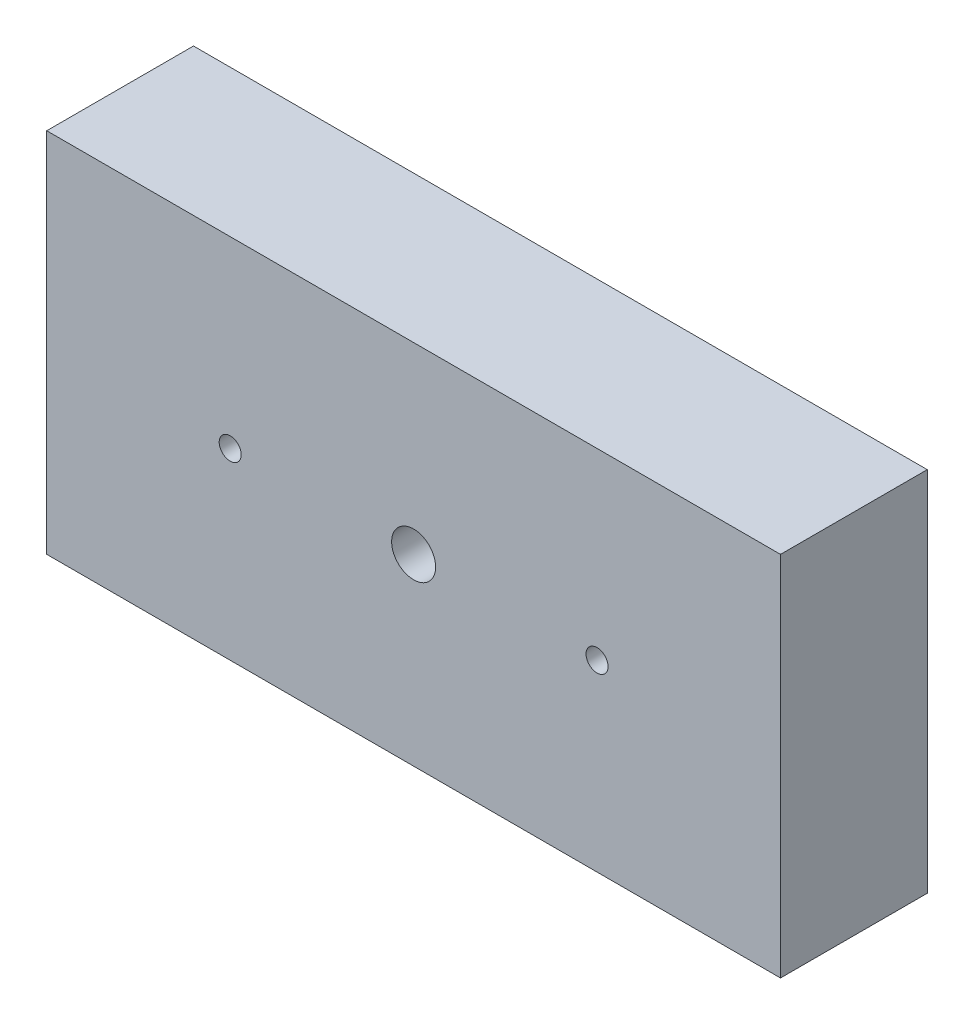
from build123d import *

# Parameters (mm, degrees)
ESQUISSE1_W             = 50
ESQUISSE1_H             = 25
ESQUISSE1_R             = 0.75
BOSS_EXTRU_1_DEPTH      = 10
ESQUISSE2_R             = 1.5
ENL_V_MAT_EXTRU_1_DEPTH = 10


with BuildPart() as part:
    # Esquisse1 → Boss.-Extru.1 (new body)
    with BuildSketch(Plane.XY):
        with Locations((25, 12.5)):
            Rectangle(ESQUISSE1_W, ESQUISSE1_H)
        with Locations((12.5, 12.5)):
            Circle(ESQUISSE1_R, mode=Mode.SUBTRACT)
        with Locations((37.5, 12.5)):
            Circle(ESQUISSE1_R, mode=Mode.SUBTRACT)
    extrude(amount=BOSS_EXTRU_1_DEPTH)

    # Esquisse2 → Enl_v. mat.-Extru.1 (cut)
    with BuildSketch(Plane.XY.offset(10)):
        with Locations((25, 12.5)):
            Circle(ESQUISSE2_R)
    extrude(amount=-ENL_V_MAT_EXTRU_1_DEPTH, mode=Mode.SUBTRACT)


solid = part.part
